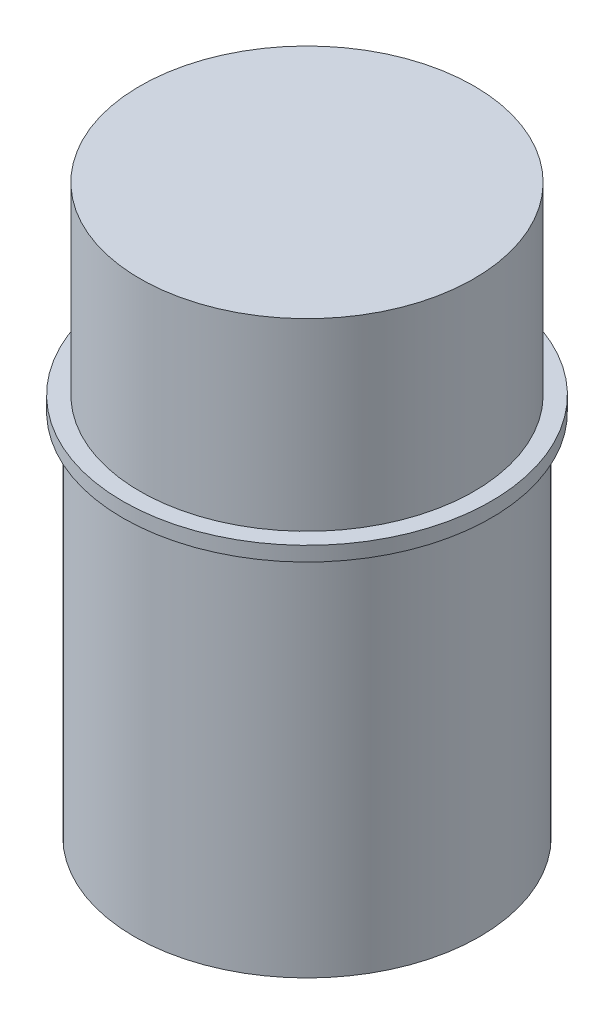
from build123d import *

# Parameters (mm, degrees)
SKETCH1_R           = 35.725
BOSS_EXTRUDE1_DEPTH = 76.2
SKETCH2_R           = 38.1
BOSS_EXTRUDE2_DEPTH = 3
SKETCH3_R           = 34.54904445
BOSS_EXTRUDE3_DEPTH = 38.1
BOSS_EXTRUDE4_DEPTH = 2
SKETCH6_W           = 73.771492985
SKETCH6_H           = 25.611566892
CUT_EXTRUDE1_DEPTH  = 146.055893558


with BuildPart() as part:
    # Sketch1 → Boss-Extrude1 (new body)
    with BuildSketch(Plane(origin=(0, 0, 0), x_dir=(1, 0, 0), z_dir=(0, 1, 0))):
        with Locations(Location((0, 0, 0), (0, 0, 90))):
            Circle(SKETCH1_R)
    extrude(amount=BOSS_EXTRUDE1_DEPTH)

    # Sketch2 → Boss-Extrude2 (add)
    with BuildSketch(Plane(origin=(0, 76.2, 0), x_dir=(1, 0, 0), z_dir=(0, 1, 0))):
        with Locations(Location((0, 0, 0), (0, 0, 270))):
            Circle(SKETCH2_R)
    extrude(amount=BOSS_EXTRUDE2_DEPTH)

    # Sketch3 → Boss-Extrude3 (add)
    with BuildSketch(Plane(origin=(0, 79.2, 0), x_dir=(1, 0, 0), z_dir=(0, 1, 0))):
        with Locations(Location((0, 0, 0), (0, 0, 90))):
            Circle(SKETCH3_R)
    extrude(amount=BOSS_EXTRUDE3_DEPTH)

    # Sketch5 → Boss-Extrude4 (add, symmetric)
    with BuildSketch(Plane.XY):
        with BuildLine():
            ThreePointArc((20.021994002, 117.3), (0, 134.09545949), (-20.021994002, 117.3))
            Line((-20.021994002, 117.3), (-17.021994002, 117.3))
            ThreePointArc((-17.021994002, 117.3), (0, 129.402197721), (17.021994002, 117.3))
            Line((17.021994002, 117.3), (20.021994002, 117.3))
        make_face()
    boss_extrude4 = extrude(amount=BOSS_EXTRUDE4_DEPTH, both=True)

    # Mirror1: Boss-Extrude4 across plane
    add(boss_extrude4.mirror(Plane.ZX.offset(58.650000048)))

    # Sketch6 → Cut-Extrude1 (cut, through all)
    with BuildSketch(Plane.XY.offset(2)):
        with Locations((2.336702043, 130.105783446)):
            Rectangle(SKETCH6_W, SKETCH6_H)
    extrude(amount=-CUT_EXTRUDE1_DEPTH, mode=Mode.SUBTRACT)


solid = part.part
